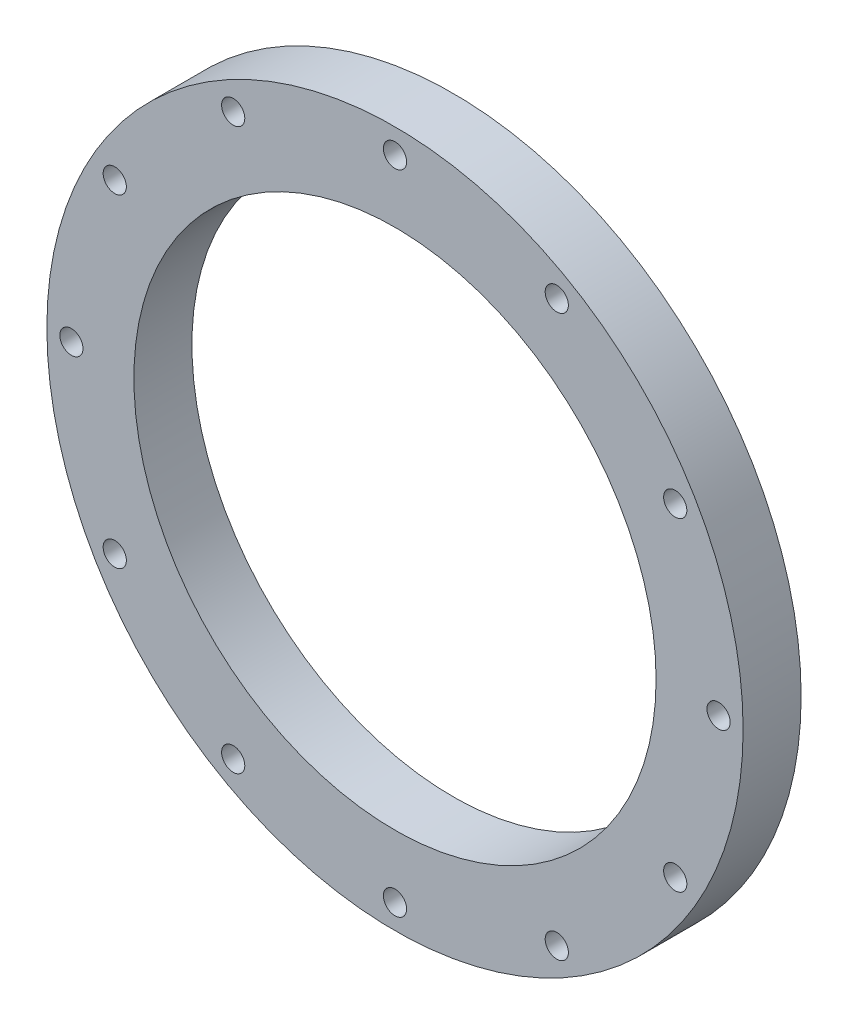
ISO-10303-21;
HEADER;
FILE_DESCRIPTION(('STEP AP214'),'2;1');
FILE_NAME('part.step','',(''),(''),'','','');
FILE_SCHEMA(('AUTOMOTIVE_DESIGN { 1 0 10303 214 1 1 1 1 }'));
ENDSEC;
DATA;
#1=APPLICATION_CONTEXT('core data for automotive mechanical design processes');
#2=APPLICATION_PROTOCOL_DEFINITION('international standard','automotive_design',2000,#1);
#3=PRODUCT_CONTEXT('',#1,'mechanical');
#4=PRODUCT('Part','Part','',(#3));
#5=PRODUCT_RELATED_PRODUCT_CATEGORY('part','',(#4));
#6=PRODUCT_DEFINITION_FORMATION('','',#4);
#7=PRODUCT_DEFINITION_CONTEXT('part definition',#1,'design');
#8=PRODUCT_DEFINITION('design','',#6,#7);
#9=PRODUCT_DEFINITION_SHAPE('','',#8);
#10=(LENGTH_UNIT() NAMED_UNIT(*) SI_UNIT(.MILLI.,.METRE.));
#11=(NAMED_UNIT(*) PLANE_ANGLE_UNIT() SI_UNIT($,.RADIAN.));
#12=(NAMED_UNIT(*) SI_UNIT($,.STERADIAN.) SOLID_ANGLE_UNIT());
#13=UNCERTAINTY_MEASURE_WITH_UNIT(LENGTH_MEASURE(1.E-05),#10,'distance_accuracy_value','');
#14=(GEOMETRIC_REPRESENTATION_CONTEXT(3) GLOBAL_UNCERTAINTY_ASSIGNED_CONTEXT((#13)) GLOBAL_UNIT_ASSIGNED_CONTEXT((#10,
#11,#12)) REPRESENTATION_CONTEXT('',''));
#15=CARTESIAN_POINT('',(0.,0.,0.));
#16=DIRECTION('',(0.,0.,1.));
#17=DIRECTION('',(1.,0.,0.));
#18=AXIS2_PLACEMENT_3D('',#15,#16,#17);
#19=CARTESIAN_POINT('',(0.,0.,50.));
#20=DIRECTION('',(0.,0.,1.));
#21=DIRECTION('',(1.,0.,0.));
#22=AXIS2_PLACEMENT_3D('',#19,#20,#21);
#23=PLANE('',#22);
#24=CARTESIAN_POINT('',(-241.48900148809,139.423740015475,50.));
#25=DIRECTION('',(0.,0.,1.));
#26=DIRECTION('',(1.,0.,0.));
#27=AXIS2_PLACEMENT_3D('',#24,#25,#26);
#28=CIRCLE('',#27,9.99517628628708);
#29=CARTESIAN_POINT('',(-231.493825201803,139.423740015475,50.));
#30=VERTEX_POINT('',#29);
#31=EDGE_CURVE('E107',#30,#30,#28,.T.);
#32=ORIENTED_EDGE('',*,*,#31,.F.);
#33=EDGE_LOOP('',(#32));
#34=FACE_BOUND('',#33,.T.);
#35=CARTESIAN_POINT('',(-241.489001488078,-139.423740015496,50.));
#36=DIRECTION('',(0.,0.,1.));
#37=DIRECTION('',(1.,0.,0.));
#38=AXIS2_PLACEMENT_3D('',#35,#36,#37);
#39=CIRCLE('',#38,9.99517628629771);
#40=CARTESIAN_POINT('',(-231.49382520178,-139.423740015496,50.));
#41=VERTEX_POINT('',#40);
#42=EDGE_CURVE('E95',#41,#41,#39,.T.);
#43=ORIENTED_EDGE('',*,*,#42,.F.);
#44=EDGE_LOOP('',(#43));
#45=FACE_BOUND('',#44,.T.);
#46=CARTESIAN_POINT('',(2.37076682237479E-11,-278.847480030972,50.));
#47=DIRECTION('',(0.,0.,1.));
#48=DIRECTION('',(1.,0.,0.));
#49=AXIS2_PLACEMENT_3D('',#46,#47,#48);
#50=CIRCLE('',#49,9.99517628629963);
#51=CARTESIAN_POINT('',(9.99517628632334,-278.847480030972,50.));
#52=VERTEX_POINT('',#51);
#53=EDGE_CURVE('E83',#52,#52,#50,.T.);
#54=ORIENTED_EDGE('',*,*,#53,.F.);
#55=EDGE_LOOP('',(#54));
#56=FACE_BOUND('',#55,.T.);
#57=CARTESIAN_POINT('',(241.489001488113,-139.423740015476,50.));
#58=DIRECTION('',(0.,0.,1.));
#59=DIRECTION('',(1.,0.,0.));
#60=AXIS2_PLACEMENT_3D('',#57,#58,#59);
#61=CIRCLE('',#60,9.99517628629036);
#62=CARTESIAN_POINT('',(251.484177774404,-139.423740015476,50.));
#63=VERTEX_POINT('',#62);
#64=EDGE_CURVE('E71',#63,#63,#61,.T.);
#65=ORIENTED_EDGE('',*,*,#64,.F.);
#66=EDGE_LOOP('',(#65));
#67=FACE_BOUND('',#66,.T.);
#68=CARTESIAN_POINT('',(241.489001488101,139.423740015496,50.));
#69=DIRECTION('',(0.,0.,1.));
#70=DIRECTION('',(1.,0.,0.));
#71=AXIS2_PLACEMENT_3D('',#68,#69,#70);
#72=CIRCLE('',#71,9.99517628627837);
#73=CARTESIAN_POINT('',(251.48417777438,139.423740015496,50.));
#74=VERTEX_POINT('',#73);
#75=EDGE_CURVE('E59',#74,#74,#72,.T.);
#76=ORIENTED_EDGE('',*,*,#75,.F.);
#77=EDGE_LOOP('',(#76));
#78=FACE_BOUND('',#77,.T.);
#79=CARTESIAN_POINT('',(0.,278.847480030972,50.));
#80=DIRECTION('',(0.,0.,1.));
#81=DIRECTION('',(1.,0.,0.));
#82=AXIS2_PLACEMENT_3D('',#79,#80,#81);
#83=CIRCLE('',#82,9.99517628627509);
#84=CARTESIAN_POINT('',(9.99517628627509,278.847480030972,50.));
#85=VERTEX_POINT('',#84);
#86=EDGE_CURVE('E47',#85,#85,#83,.T.);
#87=ORIENTED_EDGE('',*,*,#86,.F.);
#88=EDGE_LOOP('',(#87));
#89=FACE_BOUND('',#88,.T.);
#90=CARTESIAN_POINT('',(0.,0.,50.));
#91=DIRECTION('',(0.,0.,1.));
#92=DIRECTION('',(1.,0.,0.));
#93=AXIS2_PLACEMENT_3D('',#90,#91,#92);
#94=CIRCLE('',#93,300.);
#95=CARTESIAN_POINT('',(300.,0.,50.));
#96=VERTEX_POINT('',#95);
#97=EDGE_CURVE('E10',#96,#96,#94,.T.);
#98=ORIENTED_EDGE('',*,*,#97,.T.);
#99=EDGE_LOOP('',(#98));
#100=FACE_BOUND('',#99,.T.);
#101=CARTESIAN_POINT('',(0.,0.,50.));
#102=DIRECTION('',(0.,0.,1.));
#103=DIRECTION('',(1.,0.,0.));
#104=AXIS2_PLACEMENT_3D('',#101,#102,#103);
#105=CIRCLE('',#104,225.);
#106=CARTESIAN_POINT('',(225.,0.,50.));
#107=VERTEX_POINT('',#106);
#108=EDGE_CURVE('E42',#107,#107,#105,.T.);
#109=ORIENTED_EDGE('',*,*,#108,.F.);
#110=EDGE_LOOP('',(#109));
#111=FACE_BOUND('',#110,.T.);
#112=CARTESIAN_POINT('',(139.423740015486,241.489001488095,50.));
#113=DIRECTION('',(0.,0.,1.));
#114=DIRECTION('',(1.,0.,0.));
#115=AXIS2_PLACEMENT_3D('',#112,#113,#114);
#116=CIRCLE('',#115,9.99517628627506);
#117=CARTESIAN_POINT('',(149.418916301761,241.489001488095,50.));
#118=VERTEX_POINT('',#117);
#119=EDGE_CURVE('E53',#118,#118,#116,.T.);
#120=ORIENTED_EDGE('',*,*,#119,.F.);
#121=EDGE_LOOP('',(#120));
#122=FACE_BOUND('',#121,.T.);
#123=CARTESIAN_POINT('',(278.847480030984,1.1853834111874E-11,50.));
#124=DIRECTION('',(0.,0.,1.));
#125=DIRECTION('',(1.,0.,0.));
#126=AXIS2_PLACEMENT_3D('',#123,#124,#125);
#127=CIRCLE('',#126,9.99517628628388);
#128=CARTESIAN_POINT('',(288.842656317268,1.1853834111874E-11,50.));
#129=VERTEX_POINT('',#128);
#130=EDGE_CURVE('E65',#129,#129,#127,.T.);
#131=ORIENTED_EDGE('',*,*,#130,.F.);
#132=EDGE_LOOP('',(#131));
#133=FACE_BOUND('',#132,.T.);
#134=CARTESIAN_POINT('',(139.423740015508,-241.48900148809,50.));
#135=DIRECTION('',(0.,0.,1.));
#136=DIRECTION('',(1.,0.,0.));
#137=AXIS2_PLACEMENT_3D('',#134,#135,#136);
#138=CIRCLE('',#137,9.99517628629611);
#139=CARTESIAN_POINT('',(149.418916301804,-241.48900148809,50.));
#140=VERTEX_POINT('',#139);
#141=EDGE_CURVE('E77',#140,#140,#138,.T.);
#142=ORIENTED_EDGE('',*,*,#141,.F.);
#143=EDGE_LOOP('',(#142));
#144=FACE_BOUND('',#143,.T.);
#145=CARTESIAN_POINT('',(-139.423740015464,-241.489001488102,50.));
#146=DIRECTION('',(0.,0.,1.));
#147=DIRECTION('',(1.,0.,0.));
#148=AXIS2_PLACEMENT_3D('',#145,#146,#147);
#149=CIRCLE('',#148,9.99517628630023);
#150=CARTESIAN_POINT('',(-129.428563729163,-241.489001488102,50.));
#151=VERTEX_POINT('',#150);
#152=EDGE_CURVE('E89',#151,#151,#149,.T.);
#153=ORIENTED_EDGE('',*,*,#152,.F.);
#154=EDGE_LOOP('',(#153));
#155=FACE_BOUND('',#154,.T.);
#156=CARTESIAN_POINT('',(-278.84748003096,-1.1887983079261E-11,50.));
#157=DIRECTION('',(0.,0.,1.));
#158=DIRECTION('',(1.,0.,0.));
#159=AXIS2_PLACEMENT_3D('',#156,#157,#158);
#160=CIRCLE('',#159,9.99517628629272);
#161=CARTESIAN_POINT('',(-268.852303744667,-1.1887983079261E-11,50.));
#162=VERTEX_POINT('',#161);
#163=EDGE_CURVE('E101',#162,#162,#160,.T.);
#164=ORIENTED_EDGE('',*,*,#163,.F.);
#165=EDGE_LOOP('',(#164));
#166=FACE_BOUND('',#165,.T.);
#167=CARTESIAN_POINT('',(-139.423740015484,241.48900148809,50.));
#168=DIRECTION('',(0.,0.,1.));
#169=DIRECTION('',(1.,0.,0.));
#170=AXIS2_PLACEMENT_3D('',#167,#168,#169);
#171=CIRCLE('',#170,9.99517628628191);
#172=CARTESIAN_POINT('',(-129.428563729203,241.48900148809,50.));
#173=VERTEX_POINT('',#172);
#174=EDGE_CURVE('E113',#173,#173,#171,.T.);
#175=ORIENTED_EDGE('',*,*,#174,.F.);
#176=EDGE_LOOP('',(#175));
#177=FACE_BOUND('',#176,.T.);
#178=ADVANCED_FACE('F31',(#34,#45,#56,#67,#78,#89,#100,#111,#122,#133,#144,#155,#166,#177),#23,.T.);
#179=CARTESIAN_POINT('',(0.,0.,0.));
#180=DIRECTION('',(0.,0.,1.));
#181=DIRECTION('',(1.,0.,0.));
#182=AXIS2_PLACEMENT_3D('',#179,#180,#181);
#183=PLANE('',#182);
#184=CARTESIAN_POINT('',(0.,0.,0.));
#185=DIRECTION('',(0.,0.,1.));
#186=DIRECTION('',(1.,0.,0.));
#187=AXIS2_PLACEMENT_3D('',#184,#185,#186);
#188=CIRCLE('',#187,300.);
#189=CARTESIAN_POINT('',(300.,0.,0.));
#190=VERTEX_POINT('',#189);
#191=EDGE_CURVE('E35',#190,#190,#188,.T.);
#192=ORIENTED_EDGE('',*,*,#191,.F.);
#193=EDGE_LOOP('',(#192));
#194=FACE_BOUND('',#193,.T.);
#195=CARTESIAN_POINT('',(0.,0.,0.));
#196=DIRECTION('',(0.,0.,1.));
#197=DIRECTION('',(1.,0.,0.));
#198=AXIS2_PLACEMENT_3D('',#195,#196,#197);
#199=CIRCLE('',#198,225.);
#200=CARTESIAN_POINT('',(225.,0.,0.));
#201=VERTEX_POINT('',#200);
#202=EDGE_CURVE('E44',#201,#201,#199,.T.);
#203=ORIENTED_EDGE('',*,*,#202,.T.);
#204=EDGE_LOOP('',(#203));
#205=FACE_BOUND('',#204,.T.);
#206=CARTESIAN_POINT('',(0.,278.847480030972,0.));
#207=DIRECTION('',(0.,0.,1.));
#208=DIRECTION('',(1.,0.,0.));
#209=AXIS2_PLACEMENT_3D('',#206,#207,#208);
#210=CIRCLE('',#209,9.99517628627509);
#211=CARTESIAN_POINT('',(9.99517628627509,278.847480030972,0.));
#212=VERTEX_POINT('',#211);
#213=EDGE_CURVE('E50',#212,#212,#210,.T.);
#214=ORIENTED_EDGE('',*,*,#213,.T.);
#215=EDGE_LOOP('',(#214));
#216=FACE_BOUND('',#215,.T.);
#217=CARTESIAN_POINT('',(139.423740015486,241.489001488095,0.));
#218=DIRECTION('',(0.,0.,1.));
#219=DIRECTION('',(1.,0.,0.));
#220=AXIS2_PLACEMENT_3D('',#217,#218,#219);
#221=CIRCLE('',#220,9.99517628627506);
#222=CARTESIAN_POINT('',(149.418916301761,241.489001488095,0.));
#223=VERTEX_POINT('',#222);
#224=EDGE_CURVE('E56',#223,#223,#221,.T.);
#225=ORIENTED_EDGE('',*,*,#224,.T.);
#226=EDGE_LOOP('',(#225));
#227=FACE_BOUND('',#226,.T.);
#228=CARTESIAN_POINT('',(241.489001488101,139.423740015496,0.));
#229=DIRECTION('',(0.,0.,1.));
#230=DIRECTION('',(1.,0.,0.));
#231=AXIS2_PLACEMENT_3D('',#228,#229,#230);
#232=CIRCLE('',#231,9.99517628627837);
#233=CARTESIAN_POINT('',(251.48417777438,139.423740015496,0.));
#234=VERTEX_POINT('',#233);
#235=EDGE_CURVE('E62',#234,#234,#232,.T.);
#236=ORIENTED_EDGE('',*,*,#235,.T.);
#237=EDGE_LOOP('',(#236));
#238=FACE_BOUND('',#237,.T.);
#239=CARTESIAN_POINT('',(278.847480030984,1.1853834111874E-11,0.));
#240=DIRECTION('',(0.,0.,1.));
#241=DIRECTION('',(1.,0.,0.));
#242=AXIS2_PLACEMENT_3D('',#239,#240,#241);
#243=CIRCLE('',#242,9.99517628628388);
#244=CARTESIAN_POINT('',(288.842656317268,1.1853834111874E-11,0.));
#245=VERTEX_POINT('',#244);
#246=EDGE_CURVE('E68',#245,#245,#243,.T.);
#247=ORIENTED_EDGE('',*,*,#246,.T.);
#248=EDGE_LOOP('',(#247));
#249=FACE_BOUND('',#248,.T.);
#250=CARTESIAN_POINT('',(241.489001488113,-139.423740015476,0.));
#251=DIRECTION('',(0.,0.,1.));
#252=DIRECTION('',(1.,0.,0.));
#253=AXIS2_PLACEMENT_3D('',#250,#251,#252);
#254=CIRCLE('',#253,9.99517628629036);
#255=CARTESIAN_POINT('',(251.484177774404,-139.423740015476,0.));
#256=VERTEX_POINT('',#255);
#257=EDGE_CURVE('E74',#256,#256,#254,.T.);
#258=ORIENTED_EDGE('',*,*,#257,.T.);
#259=EDGE_LOOP('',(#258));
#260=FACE_BOUND('',#259,.T.);
#261=CARTESIAN_POINT('',(139.423740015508,-241.48900148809,0.));
#262=DIRECTION('',(0.,0.,1.));
#263=DIRECTION('',(1.,0.,0.));
#264=AXIS2_PLACEMENT_3D('',#261,#262,#263);
#265=CIRCLE('',#264,9.99517628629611);
#266=CARTESIAN_POINT('',(149.418916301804,-241.48900148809,0.));
#267=VERTEX_POINT('',#266);
#268=EDGE_CURVE('E80',#267,#267,#265,.T.);
#269=ORIENTED_EDGE('',*,*,#268,.T.);
#270=EDGE_LOOP('',(#269));
#271=FACE_BOUND('',#270,.T.);
#272=CARTESIAN_POINT('',(2.37076682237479E-11,-278.847480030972,0.));
#273=DIRECTION('',(0.,0.,1.));
#274=DIRECTION('',(1.,0.,0.));
#275=AXIS2_PLACEMENT_3D('',#272,#273,#274);
#276=CIRCLE('',#275,9.99517628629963);
#277=CARTESIAN_POINT('',(9.99517628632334,-278.847480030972,0.));
#278=VERTEX_POINT('',#277);
#279=EDGE_CURVE('E86',#278,#278,#276,.T.);
#280=ORIENTED_EDGE('',*,*,#279,.T.);
#281=EDGE_LOOP('',(#280));
#282=FACE_BOUND('',#281,.T.);
#283=CARTESIAN_POINT('',(-139.423740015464,-241.489001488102,0.));
#284=DIRECTION('',(0.,0.,1.));
#285=DIRECTION('',(1.,0.,0.));
#286=AXIS2_PLACEMENT_3D('',#283,#284,#285);
#287=CIRCLE('',#286,9.99517628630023);
#288=CARTESIAN_POINT('',(-129.428563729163,-241.489001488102,0.));
#289=VERTEX_POINT('',#288);
#290=EDGE_CURVE('E92',#289,#289,#287,.T.);
#291=ORIENTED_EDGE('',*,*,#290,.T.);
#292=EDGE_LOOP('',(#291));
#293=FACE_BOUND('',#292,.T.);
#294=CARTESIAN_POINT('',(-241.489001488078,-139.423740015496,0.));
#295=DIRECTION('',(0.,0.,1.));
#296=DIRECTION('',(1.,0.,0.));
#297=AXIS2_PLACEMENT_3D('',#294,#295,#296);
#298=CIRCLE('',#297,9.99517628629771);
#299=CARTESIAN_POINT('',(-231.49382520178,-139.423740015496,0.));
#300=VERTEX_POINT('',#299);
#301=EDGE_CURVE('E98',#300,#300,#298,.T.);
#302=ORIENTED_EDGE('',*,*,#301,.T.);
#303=EDGE_LOOP('',(#302));
#304=FACE_BOUND('',#303,.T.);
#305=CARTESIAN_POINT('',(-278.84748003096,-1.1887983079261E-11,0.));
#306=DIRECTION('',(0.,0.,1.));
#307=DIRECTION('',(1.,0.,0.));
#308=AXIS2_PLACEMENT_3D('',#305,#306,#307);
#309=CIRCLE('',#308,9.99517628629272);
#310=CARTESIAN_POINT('',(-268.852303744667,-1.1887983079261E-11,0.));
#311=VERTEX_POINT('',#310);
#312=EDGE_CURVE('E104',#311,#311,#309,.T.);
#313=ORIENTED_EDGE('',*,*,#312,.T.);
#314=EDGE_LOOP('',(#313));
#315=FACE_BOUND('',#314,.T.);
#316=CARTESIAN_POINT('',(-241.48900148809,139.423740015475,0.));
#317=DIRECTION('',(0.,0.,1.));
#318=DIRECTION('',(1.,0.,0.));
#319=AXIS2_PLACEMENT_3D('',#316,#317,#318);
#320=CIRCLE('',#319,9.99517628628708);
#321=CARTESIAN_POINT('',(-231.493825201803,139.423740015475,0.));
#322=VERTEX_POINT('',#321);
#323=EDGE_CURVE('E110',#322,#322,#320,.T.);
#324=ORIENTED_EDGE('',*,*,#323,.T.);
#325=EDGE_LOOP('',(#324));
#326=FACE_BOUND('',#325,.T.);
#327=CARTESIAN_POINT('',(-139.423740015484,241.48900148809,0.));
#328=DIRECTION('',(0.,0.,1.));
#329=DIRECTION('',(1.,0.,0.));
#330=AXIS2_PLACEMENT_3D('',#327,#328,#329);
#331=CIRCLE('',#330,9.99517628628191);
#332=CARTESIAN_POINT('',(-129.428563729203,241.48900148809,0.));
#333=VERTEX_POINT('',#332);
#334=EDGE_CURVE('E116',#333,#333,#331,.T.);
#335=ORIENTED_EDGE('',*,*,#334,.T.);
#336=EDGE_LOOP('',(#335));
#337=FACE_BOUND('',#336,.T.);
#338=ADVANCED_FACE('F126',(#194,#205,#216,#227,#238,#249,#260,#271,#282,#293,#304,#315,#326,
#337),#183,.F.);
#339=CARTESIAN_POINT('',(0.,0.,50.));
#340=DIRECTION('',(0.,0.,-1.));
#341=DIRECTION('',(-1.,0.,0.));
#342=AXIS2_PLACEMENT_3D('',#339,#340,#341);
#343=CYLINDRICAL_SURFACE('',#342,300.);
#344=ORIENTED_EDGE('',*,*,#97,.F.);
#345=EDGE_LOOP('',(#344));
#346=FACE_BOUND('',#345,.T.);
#347=ORIENTED_EDGE('',*,*,#191,.T.);
#348=EDGE_LOOP('',(#347));
#349=FACE_BOUND('',#348,.T.);
#350=ADVANCED_FACE('F33',(#346,#349),#343,.T.);
#351=CARTESIAN_POINT('',(0.,0.,50.));
#352=DIRECTION('',(0.,0.,-1.));
#353=DIRECTION('',(-1.,0.,0.));
#354=AXIS2_PLACEMENT_3D('',#351,#352,#353);
#355=CYLINDRICAL_SURFACE('',#354,225.);
#356=ORIENTED_EDGE('',*,*,#108,.T.);
#357=EDGE_LOOP('',(#356));
#358=FACE_BOUND('',#357,.T.);
#359=ORIENTED_EDGE('',*,*,#202,.F.);
#360=EDGE_LOOP('',(#359));
#361=FACE_BOUND('',#360,.T.);
#362=ADVANCED_FACE('F136',(#358,#361),#355,.F.);
#363=CARTESIAN_POINT('',(0.,278.847480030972,50.));
#364=DIRECTION('',(0.,0.,-1.));
#365=DIRECTION('',(-1.,0.,0.));
#366=AXIS2_PLACEMENT_3D('',#363,#364,#365);
#367=CYLINDRICAL_SURFACE('',#366,9.99517628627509);
#368=ORIENTED_EDGE('',*,*,#86,.T.);
#369=EDGE_LOOP('',(#368));
#370=FACE_BOUND('',#369,.T.);
#371=ORIENTED_EDGE('',*,*,#213,.F.);
#372=EDGE_LOOP('',(#371));
#373=FACE_BOUND('',#372,.T.);
#374=ADVANCED_FACE('F139',(#370,#373),#367,.F.);
#375=CARTESIAN_POINT('',(139.423740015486,241.489001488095,50.));
#376=DIRECTION('',(0.,0.,-1.));
#377=DIRECTION('',(-1.,0.,0.));
#378=AXIS2_PLACEMENT_3D('',#375,#376,#377);
#379=CYLINDRICAL_SURFACE('',#378,9.99517628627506);
#380=ORIENTED_EDGE('',*,*,#119,.T.);
#381=EDGE_LOOP('',(#380));
#382=FACE_BOUND('',#381,.T.);
#383=ORIENTED_EDGE('',*,*,#224,.F.);
#384=EDGE_LOOP('',(#383));
#385=FACE_BOUND('',#384,.T.);
#386=ADVANCED_FACE('F143',(#382,#385),#379,.F.);
#387=CARTESIAN_POINT('',(241.489001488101,139.423740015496,50.));
#388=DIRECTION('',(0.,0.,-1.));
#389=DIRECTION('',(-1.,0.,0.));
#390=AXIS2_PLACEMENT_3D('',#387,#388,#389);
#391=CYLINDRICAL_SURFACE('',#390,9.99517628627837);
#392=ORIENTED_EDGE('',*,*,#75,.T.);
#393=EDGE_LOOP('',(#392));
#394=FACE_BOUND('',#393,.T.);
#395=ORIENTED_EDGE('',*,*,#235,.F.);
#396=EDGE_LOOP('',(#395));
#397=FACE_BOUND('',#396,.T.);
#398=ADVANCED_FACE('F147',(#394,#397),#391,.F.);
#399=CARTESIAN_POINT('',(278.847480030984,1.1853834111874E-11,50.));
#400=DIRECTION('',(0.,0.,-1.));
#401=DIRECTION('',(-1.,0.,0.));
#402=AXIS2_PLACEMENT_3D('',#399,#400,#401);
#403=CYLINDRICAL_SURFACE('',#402,9.99517628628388);
#404=ORIENTED_EDGE('',*,*,#130,.T.);
#405=EDGE_LOOP('',(#404));
#406=FACE_BOUND('',#405,.T.);
#407=ORIENTED_EDGE('',*,*,#246,.F.);
#408=EDGE_LOOP('',(#407));
#409=FACE_BOUND('',#408,.T.);
#410=ADVANCED_FACE('F151',(#406,#409),#403,.F.);
#411=CARTESIAN_POINT('',(241.489001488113,-139.423740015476,50.));
#412=DIRECTION('',(0.,0.,-1.));
#413=DIRECTION('',(-1.,0.,0.));
#414=AXIS2_PLACEMENT_3D('',#411,#412,#413);
#415=CYLINDRICAL_SURFACE('',#414,9.99517628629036);
#416=ORIENTED_EDGE('',*,*,#64,.T.);
#417=EDGE_LOOP('',(#416));
#418=FACE_BOUND('',#417,.T.);
#419=ORIENTED_EDGE('',*,*,#257,.F.);
#420=EDGE_LOOP('',(#419));
#421=FACE_BOUND('',#420,.T.);
#422=ADVANCED_FACE('F155',(#418,#421),#415,.F.);
#423=CARTESIAN_POINT('',(139.423740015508,-241.48900148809,50.));
#424=DIRECTION('',(0.,0.,-1.));
#425=DIRECTION('',(-1.,0.,0.));
#426=AXIS2_PLACEMENT_3D('',#423,#424,#425);
#427=CYLINDRICAL_SURFACE('',#426,9.99517628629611);
#428=ORIENTED_EDGE('',*,*,#141,.T.);
#429=EDGE_LOOP('',(#428));
#430=FACE_BOUND('',#429,.T.);
#431=ORIENTED_EDGE('',*,*,#268,.F.);
#432=EDGE_LOOP('',(#431));
#433=FACE_BOUND('',#432,.T.);
#434=ADVANCED_FACE('F159',(#430,#433),#427,.F.);
#435=CARTESIAN_POINT('',(2.37076682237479E-11,-278.847480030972,50.));
#436=DIRECTION('',(0.,0.,-1.));
#437=DIRECTION('',(-1.,0.,0.));
#438=AXIS2_PLACEMENT_3D('',#435,#436,#437);
#439=CYLINDRICAL_SURFACE('',#438,9.99517628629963);
#440=ORIENTED_EDGE('',*,*,#53,.T.);
#441=EDGE_LOOP('',(#440));
#442=FACE_BOUND('',#441,.T.);
#443=ORIENTED_EDGE('',*,*,#279,.F.);
#444=EDGE_LOOP('',(#443));
#445=FACE_BOUND('',#444,.T.);
#446=ADVANCED_FACE('F163',(#442,#445),#439,.F.);
#447=CARTESIAN_POINT('',(-139.423740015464,-241.489001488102,50.));
#448=DIRECTION('',(0.,0.,-1.));
#449=DIRECTION('',(-1.,0.,0.));
#450=AXIS2_PLACEMENT_3D('',#447,#448,#449);
#451=CYLINDRICAL_SURFACE('',#450,9.99517628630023);
#452=ORIENTED_EDGE('',*,*,#152,.T.);
#453=EDGE_LOOP('',(#452));
#454=FACE_BOUND('',#453,.T.);
#455=ORIENTED_EDGE('',*,*,#290,.F.);
#456=EDGE_LOOP('',(#455));
#457=FACE_BOUND('',#456,.T.);
#458=ADVANCED_FACE('F167',(#454,#457),#451,.F.);
#459=CARTESIAN_POINT('',(-241.489001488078,-139.423740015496,50.));
#460=DIRECTION('',(0.,0.,-1.));
#461=DIRECTION('',(-1.,0.,0.));
#462=AXIS2_PLACEMENT_3D('',#459,#460,#461);
#463=CYLINDRICAL_SURFACE('',#462,9.99517628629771);
#464=ORIENTED_EDGE('',*,*,#42,.T.);
#465=EDGE_LOOP('',(#464));
#466=FACE_BOUND('',#465,.T.);
#467=ORIENTED_EDGE('',*,*,#301,.F.);
#468=EDGE_LOOP('',(#467));
#469=FACE_BOUND('',#468,.T.);
#470=ADVANCED_FACE('F171',(#466,#469),#463,.F.);
#471=CARTESIAN_POINT('',(-278.84748003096,-1.1887983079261E-11,50.));
#472=DIRECTION('',(0.,0.,-1.));
#473=DIRECTION('',(-1.,0.,0.));
#474=AXIS2_PLACEMENT_3D('',#471,#472,#473);
#475=CYLINDRICAL_SURFACE('',#474,9.99517628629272);
#476=ORIENTED_EDGE('',*,*,#163,.T.);
#477=EDGE_LOOP('',(#476));
#478=FACE_BOUND('',#477,.T.);
#479=ORIENTED_EDGE('',*,*,#312,.F.);
#480=EDGE_LOOP('',(#479));
#481=FACE_BOUND('',#480,.T.);
#482=ADVANCED_FACE('F175',(#478,#481),#475,.F.);
#483=CARTESIAN_POINT('',(-241.48900148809,139.423740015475,50.));
#484=DIRECTION('',(0.,0.,-1.));
#485=DIRECTION('',(-1.,0.,0.));
#486=AXIS2_PLACEMENT_3D('',#483,#484,#485);
#487=CYLINDRICAL_SURFACE('',#486,9.99517628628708);
#488=ORIENTED_EDGE('',*,*,#31,.T.);
#489=EDGE_LOOP('',(#488));
#490=FACE_BOUND('',#489,.T.);
#491=ORIENTED_EDGE('',*,*,#323,.F.);
#492=EDGE_LOOP('',(#491));
#493=FACE_BOUND('',#492,.T.);
#494=ADVANCED_FACE('F179',(#490,#493),#487,.F.);
#495=CARTESIAN_POINT('',(-139.423740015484,241.48900148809,50.));
#496=DIRECTION('',(0.,0.,-1.));
#497=DIRECTION('',(-1.,0.,0.));
#498=AXIS2_PLACEMENT_3D('',#495,#496,#497);
#499=CYLINDRICAL_SURFACE('',#498,9.99517628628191);
#500=ORIENTED_EDGE('',*,*,#174,.T.);
#501=EDGE_LOOP('',(#500));
#502=FACE_BOUND('',#501,.T.);
#503=ORIENTED_EDGE('',*,*,#334,.F.);
#504=EDGE_LOOP('',(#503));
#505=FACE_BOUND('',#504,.T.);
#506=ADVANCED_FACE('F122',(#502,#505),#499,.F.);
#507=CLOSED_SHELL('',(#178,#338,#350,#362,#374,#386,#398,#410,#422,#434,#446,#458,#470,#482,
#494,#506));
#508=MANIFOLD_SOLID_BREP('B2',#507);
#509=ADVANCED_BREP_SHAPE_REPRESENTATION('',(#18,#508),#14);
#510=SHAPE_DEFINITION_REPRESENTATION(#9,#509);
ENDSEC;
END-ISO-10303-21;
